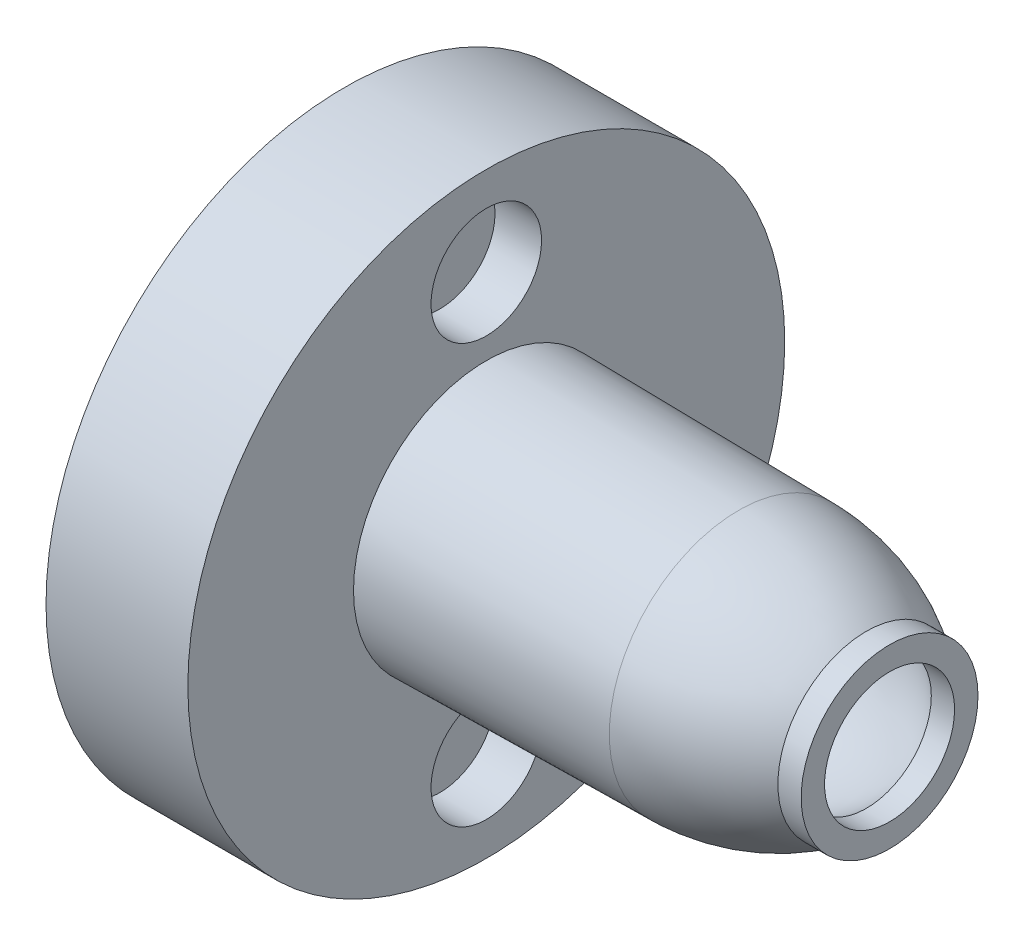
ISO-10303-21;
HEADER;
FILE_DESCRIPTION(('STEP AP214'),'2;1');
FILE_NAME('part.step','',(''),(''),'','','');
FILE_SCHEMA(('AUTOMOTIVE_DESIGN { 1 0 10303 214 1 1 1 1 }'));
ENDSEC;
DATA;
#1=APPLICATION_CONTEXT('core data for automotive mechanical design processes');
#2=APPLICATION_PROTOCOL_DEFINITION('international standard','automotive_design',2000,#1);
#3=PRODUCT_CONTEXT('',#1,'mechanical');
#4=PRODUCT('Part','Part','',(#3));
#5=PRODUCT_RELATED_PRODUCT_CATEGORY('part','',(#4));
#6=PRODUCT_DEFINITION_FORMATION('','',#4);
#7=PRODUCT_DEFINITION_CONTEXT('part definition',#1,'design');
#8=PRODUCT_DEFINITION('design','',#6,#7);
#9=PRODUCT_DEFINITION_SHAPE('','',#8);
#10=(LENGTH_UNIT() NAMED_UNIT(*) SI_UNIT(.MILLI.,.METRE.));
#11=(NAMED_UNIT(*) PLANE_ANGLE_UNIT() SI_UNIT($,.RADIAN.));
#12=(NAMED_UNIT(*) SI_UNIT($,.STERADIAN.) SOLID_ANGLE_UNIT());
#13=UNCERTAINTY_MEASURE_WITH_UNIT(LENGTH_MEASURE(1.E-05),#10,'distance_accuracy_value','');
#14=(GEOMETRIC_REPRESENTATION_CONTEXT(3) GLOBAL_UNCERTAINTY_ASSIGNED_CONTEXT((#13)) GLOBAL_UNIT_ASSIGNED_CONTEXT((#10,
#11,#12)) REPRESENTATION_CONTEXT('',''));
#15=CARTESIAN_POINT('',(0.,0.,0.));
#16=DIRECTION('',(0.,0.,1.));
#17=DIRECTION('',(1.,0.,0.));
#18=AXIS2_PLACEMENT_3D('',#15,#16,#17);
#19=CARTESIAN_POINT('',(-6.48640049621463,0.,-4.15921814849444));
#20=DIRECTION('',(-1.,0.,0.));
#21=DIRECTION('',(0.,0.,1.));
#22=AXIS2_PLACEMENT_3D('',#19,#20,#21);
#23=PLANE('',#22);
#24=CARTESIAN_POINT('',(-6.48640049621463,0.,1.40090629));
#25=DIRECTION('',(1.,0.,0.));
#26=DIRECTION('',(0.,0.,-1.));
#27=AXIS2_PLACEMENT_3D('',#24,#25,#26);
#28=CIRCLE('',#27,4.63348082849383);
#29=CARTESIAN_POINT('',(-6.48640049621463,0.,-3.23257453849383));
#30=VERTEX_POINT('',#29);
#31=EDGE_CURVE('E46',#30,#30,#28,.T.);
#32=ORIENTED_EDGE('',*,*,#31,.T.);
#33=EDGE_LOOP('',(#32));
#34=FACE_BOUND('',#33,.T.);
#35=CARTESIAN_POINT('',(-6.48640049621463,0.,1.40090629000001));
#36=DIRECTION('',(1.,0.,0.));
#37=DIRECTION('',(0.,0.,-1.));
#38=AXIS2_PLACEMENT_3D('',#35,#36,#37);
#39=CIRCLE('',#38,4.76049260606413);
#40=CARTESIAN_POINT('',(-6.48640049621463,0.,-3.35958631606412));
#41=VERTEX_POINT('',#40);
#42=EDGE_CURVE('E10',#41,#41,#39,.T.);
#43=ORIENTED_EDGE('',*,*,#42,.F.);
#44=EDGE_LOOP('',(#43));
#45=FACE_BOUND('',#44,.T.);
#46=ADVANCED_FACE('F42',(#34,#45),#23,.T.);
#47=CARTESIAN_POINT('',(-6.50584710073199,0.,1.40090629));
#48=DIRECTION('',(1.,0.,0.));
#49=DIRECTION('',(0.,0.,-1.));
#50=AXIS2_PLACEMENT_3D('',#47,#48,#49);
#51=DEGENERATE_TOROIDAL_SURFACE('',#50,3.9331386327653,9.49328298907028,.F.);
#52=CARTESIAN_POINT('',(-6.48640049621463,0.,1.40090629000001));
#53=DIRECTION('',(1.,0.,0.));
#54=DIRECTION('',(0.,0.,-1.));
#55=AXIS2_PLACEMENT_3D('',#52,#53,#54);
#56=CIRCLE('',#55,5.56012443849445);
#57=CARTESIAN_POINT('',(-6.48640049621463,0.,-4.15921814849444));
#58=VERTEX_POINT('',#57);
#59=EDGE_CURVE('E61',#58,#58,#56,.T.);
#60=ORIENTED_EDGE('',*,*,#59,.T.);
#61=EDGE_LOOP('',(#60));
#62=FACE_BOUND('',#61,.T.);
#63=CARTESIAN_POINT('',(-0.999988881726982,0.,1.40090629));
#64=DIRECTION('',(1.,0.,0.));
#65=DIRECTION('',(0.,0.,-1.));
#66=AXIS2_PLACEMENT_3D('',#63,#64,#65);
#67=CIRCLE('',#66,3.80042116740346);
#68=CARTESIAN_POINT('',(-0.999988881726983,0.,-2.39951487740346));
#69=VERTEX_POINT('',#68);
#70=EDGE_CURVE('E69',#69,#69,#67,.T.);
#71=ORIENTED_EDGE('',*,*,#70,.F.);
#72=EDGE_LOOP('',(#71));
#73=FACE_BOUND('',#72,.T.);
#74=ADVANCED_FACE('F44',(#62,#73),#51,.F.);
#75=CARTESIAN_POINT('',(-6.6446004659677,0.,1.40090629));
#76=DIRECTION('',(1.,0.,0.));
#77=DIRECTION('',(0.,0.,-1.));
#78=AXIS2_PLACEMENT_3D('',#75,#76,#77);
#79=DEGENERATE_TOROIDAL_SURFACE('',#78,4.93992013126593,9.57470799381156,.F.);
#80=CARTESIAN_POINT('',(-1.00000016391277,0.,1.40090629));
#81=DIRECTION('',(1.,0.,0.));
#82=DIRECTION('',(0.,0.,-1.));
#83=AXIS2_PLACEMENT_3D('',#80,#81,#82);
#84=CIRCLE('',#83,2.794);
#85=CARTESIAN_POINT('',(-1.00000016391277,0.,-1.39309371));
#86=VERTEX_POINT('',#85);
#87=EDGE_CURVE('E56',#86,#86,#84,.T.);
#88=ORIENTED_EDGE('',*,*,#87,.T.);
#89=EDGE_LOOP('',(#88));
#90=FACE_BOUND('',#89,.T.);
#91=ORIENTED_EDGE('',*,*,#31,.F.);
#92=EDGE_LOOP('',(#91));
#93=FACE_BOUND('',#92,.T.);
#94=ADVANCED_FACE('F84',(#90,#93),#79,.T.);
#95=CARTESIAN_POINT('',(0.,0.,1.40090629));
#96=DIRECTION('',(1.,0.,0.));
#97=DIRECTION('',(0.,0.,-1.));
#98=AXIS2_PLACEMENT_3D('',#95,#96,#97);
#99=CYLINDRICAL_SURFACE('',#98,2.794);
#100=CARTESIAN_POINT('',(1.22508245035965E-05,0.,1.40090629));
#101=DIRECTION('',(1.,0.,0.));
#102=DIRECTION('',(0.,0.,-1.));
#103=AXIS2_PLACEMENT_3D('',#100,#101,#102);
#104=CIRCLE('',#103,2.794);
#105=CARTESIAN_POINT('',(1.22508245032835E-05,0.,-1.39309371));
#106=VERTEX_POINT('',#105);
#107=EDGE_CURVE('E77',#106,#106,#104,.T.);
#108=ORIENTED_EDGE('',*,*,#107,.T.);
#109=EDGE_LOOP('',(#108));
#110=FACE_BOUND('',#109,.T.);
#111=ORIENTED_EDGE('',*,*,#87,.F.);
#112=EDGE_LOOP('',(#111));
#113=FACE_BOUND('',#112,.T.);
#114=ADVANCED_FACE('F87',(#110,#113),#99,.F.);
#115=CARTESIAN_POINT('',(1.22508245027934E-05,0.,-2.39951487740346));
#116=DIRECTION('',(1.,0.,0.));
#117=DIRECTION('',(0.,0.,-1.));
#118=AXIS2_PLACEMENT_3D('',#115,#116,#117);
#119=PLANE('',#118);
#120=CARTESIAN_POINT('',(1.22508245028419E-05,0.,1.40090629));
#121=DIRECTION('',(1.,0.,0.));
#122=DIRECTION('',(0.,0.,-1.));
#123=AXIS2_PLACEMENT_3D('',#120,#121,#122);
#124=CIRCLE('',#123,3.80042116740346);
#125=CARTESIAN_POINT('',(1.22508245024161E-05,0.,-2.39951487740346));
#126=VERTEX_POINT('',#125);
#127=EDGE_CURVE('E73',#126,#126,#124,.T.);
#128=ORIENTED_EDGE('',*,*,#127,.T.);
#129=EDGE_LOOP('',(#128));
#130=FACE_BOUND('',#129,.T.);
#131=ORIENTED_EDGE('',*,*,#107,.F.);
#132=EDGE_LOOP('',(#131));
#133=FACE_BOUND('',#132,.T.);
#134=ADVANCED_FACE('F89',(#130,#133),#119,.T.);
#135=CARTESIAN_POINT('',(0.,0.,1.40090629));
#136=DIRECTION('',(1.,0.,0.));
#137=DIRECTION('',(0.,0.,-1.));
#138=AXIS2_PLACEMENT_3D('',#135,#136,#137);
#139=CYLINDRICAL_SURFACE('',#138,3.80042116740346);
#140=ORIENTED_EDGE('',*,*,#70,.T.);
#141=EDGE_LOOP('',(#140));
#142=FACE_BOUND('',#141,.T.);
#143=ORIENTED_EDGE('',*,*,#127,.F.);
#144=EDGE_LOOP('',(#143));
#145=FACE_BOUND('',#144,.T.);
#146=ADVANCED_FACE('F96',(#142,#145),#139,.T.);
#147=CARTESIAN_POINT('',(-6.48640049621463,0.,1.40090629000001));
#148=DIRECTION('',(-1.,0.,0.));
#149=DIRECTION('',(0.,0.,1.));
#150=AXIS2_PLACEMENT_3D('',#147,#148,#149);
#151=CONICAL_SURFACE('',#150,5.56012443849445,0.0136183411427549);
#152=CARTESIAN_POINT('',(-17.3322001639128,0.,1.40090629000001));
#153=DIRECTION('',(1.,0.,0.));
#154=DIRECTION('',(0.,0.,-1.));
#155=AXIS2_PLACEMENT_3D('',#152,#153,#154);
#156=CIRCLE('',#155,5.7078353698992);
#157=CARTESIAN_POINT('',(-17.3322001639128,0.,-4.30692907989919));
#158=VERTEX_POINT('',#157);
#159=EDGE_CURVE('E65',#158,#158,#156,.T.);
#160=ORIENTED_EDGE('',*,*,#159,.T.);
#161=EDGE_LOOP('',(#160));
#162=FACE_BOUND('',#161,.T.);
#163=ORIENTED_EDGE('',*,*,#59,.F.);
#164=EDGE_LOOP('',(#163));
#165=FACE_BOUND('',#164,.T.);
#166=ADVANCED_FACE('F117',(#162,#165),#151,.T.);
#167=CARTESIAN_POINT('',(-6.48640049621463,0.,1.40090629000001));
#168=DIRECTION('',(-1.,0.,0.));
#169=DIRECTION('',(0.,0.,1.));
#170=AXIS2_PLACEMENT_3D('',#167,#168,#169);
#171=CONICAL_SURFACE('',#170,4.76049260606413,0.0136183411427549);
#172=CARTESIAN_POINT('',(-23.4282001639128,0.,1.40090629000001));
#173=DIRECTION('',(1.,0.,0.));
#174=DIRECTION('',(0.,0.,-1.));
#175=AXIS2_PLACEMENT_3D('',#172,#173,#174);
#176=CIRCLE('',#175,4.99122607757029);
#177=CARTESIAN_POINT('',(-23.4282001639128,0.,-3.59031978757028));
#178=VERTEX_POINT('',#177);
#179=EDGE_CURVE('E59',#178,#178,#176,.T.);
#180=ORIENTED_EDGE('',*,*,#179,.F.);
#181=EDGE_LOOP('',(#180));
#182=FACE_BOUND('',#181,.T.);
#183=ORIENTED_EDGE('',*,*,#42,.T.);
#184=EDGE_LOOP('',(#183));
#185=FACE_BOUND('',#184,.T.);
#186=ADVANCED_FACE('F124',(#182,#185),#171,.F.);
#187=CARTESIAN_POINT('',(-23.4282001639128,0.,-11.42609371));
#188=DIRECTION('',(-1.,0.,0.));
#189=DIRECTION('',(0.,0.,1.));
#190=AXIS2_PLACEMENT_3D('',#187,#188,#189);
#191=PLANE('',#190);
#192=ORIENTED_EDGE('',*,*,#179,.T.);
#193=EDGE_LOOP('',(#192));
#194=FACE_BOUND('',#193,.T.);
#195=CARTESIAN_POINT('',(-23.4282001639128,0.,1.40090629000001));
#196=DIRECTION('',(1.,0.,0.));
#197=DIRECTION('',(0.,0.,-1.));
#198=AXIS2_PLACEMENT_3D('',#195,#196,#197);
#199=CIRCLE('',#198,12.827);
#200=CARTESIAN_POINT('',(-23.4282001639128,0.,-11.42609371));
#201=VERTEX_POINT('',#200);
#202=EDGE_CURVE('E170',#201,#201,#199,.T.);
#203=ORIENTED_EDGE('',*,*,#202,.F.);
#204=EDGE_LOOP('',(#203));
#205=FACE_BOUND('',#204,.T.);
#206=ADVANCED_FACE('F130',(#194,#205),#191,.T.);
#207=CARTESIAN_POINT('',(8.32179983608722,0.,1.40090629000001));
#208=DIRECTION('',(1.,0.,0.));
#209=DIRECTION('',(0.,0.,-1.));
#210=AXIS2_PLACEMENT_3D('',#207,#208,#209);
#211=CYLINDRICAL_SURFACE('',#210,12.827);
#212=ORIENTED_EDGE('',*,*,#202,.T.);
#213=EDGE_LOOP('',(#212));
#214=FACE_BOUND('',#213,.T.);
#215=CARTESIAN_POINT('',(-17.3322001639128,0.,1.40090629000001));
#216=DIRECTION('',(1.,0.,0.));
#217=DIRECTION('',(0.,0.,-1.));
#218=AXIS2_PLACEMENT_3D('',#215,#216,#217);
#219=CIRCLE('',#218,12.827);
#220=CARTESIAN_POINT('',(-17.3322001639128,0.,-11.42609371));
#221=VERTEX_POINT('',#220);
#222=EDGE_CURVE('E164',#221,#221,#219,.T.);
#223=ORIENTED_EDGE('',*,*,#222,.F.);
#224=EDGE_LOOP('',(#223));
#225=FACE_BOUND('',#224,.T.);
#226=ADVANCED_FACE('F134',(#214,#225),#211,.T.);
#227=CARTESIAN_POINT('',(-17.3322001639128,0.,-7.10809370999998));
#228=DIRECTION('',(1.,0.,0.));
#229=DIRECTION('',(0.,0.,-1.));
#230=AXIS2_PLACEMENT_3D('',#227,#228,#229);
#231=PLANE('',#230);
#232=CARTESIAN_POINT('',(-17.3322001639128,-9.,1.40090629));
#233=DIRECTION('',(1.,0.,0.));
#234=DIRECTION('',(0.,0.,-1.));
#235=AXIS2_PLACEMENT_3D('',#232,#233,#234);
#236=CIRCLE('',#235,2.375);
#237=CARTESIAN_POINT('',(-17.3322001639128,-9.,-0.974093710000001));
#238=VERTEX_POINT('',#237);
#239=EDGE_CURVE('E165',#238,#238,#236,.T.);
#240=ORIENTED_EDGE('',*,*,#239,.F.);
#241=EDGE_LOOP('',(#240));
#242=FACE_BOUND('',#241,.T.);
#243=CARTESIAN_POINT('',(-17.3322001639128,9.,1.40090629));
#244=DIRECTION('',(1.,0.,0.));
#245=DIRECTION('',(0.,0.,-1.));
#246=AXIS2_PLACEMENT_3D('',#243,#244,#245);
#247=CIRCLE('',#246,2.375);
#248=CARTESIAN_POINT('',(-17.3322001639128,9.,-0.974093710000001));
#249=VERTEX_POINT('',#248);
#250=EDGE_CURVE('E173',#249,#249,#247,.T.);
#251=ORIENTED_EDGE('',*,*,#250,.F.);
#252=EDGE_LOOP('',(#251));
#253=FACE_BOUND('',#252,.T.);
#254=ORIENTED_EDGE('',*,*,#159,.F.);
#255=EDGE_LOOP('',(#254));
#256=FACE_BOUND('',#255,.T.);
#257=ORIENTED_EDGE('',*,*,#222,.T.);
#258=EDGE_LOOP('',(#257));
#259=FACE_BOUND('',#258,.T.);
#260=ADVANCED_FACE('F138',(#242,#253,#256,#259),#231,.T.);
#261=CARTESIAN_POINT('',(-19.3322001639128,9.,1.40090629));
#262=DIRECTION('',(1.,0.,0.));
#263=DIRECTION('',(0.,0.,-1.));
#264=AXIS2_PLACEMENT_3D('',#261,#262,#263);
#265=CYLINDRICAL_SURFACE('',#264,2.375);
#266=CARTESIAN_POINT('',(-19.3322001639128,9.,1.40090629));
#267=DIRECTION('',(1.,0.,0.));
#268=DIRECTION('',(0.,0.,-1.));
#269=AXIS2_PLACEMENT_3D('',#266,#267,#268);
#270=CIRCLE('',#269,2.375);
#271=CARTESIAN_POINT('',(-19.3322001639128,9.,-0.974093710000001));
#272=VERTEX_POINT('',#271);
#273=EDGE_CURVE('E179',#272,#272,#270,.T.);
#274=ORIENTED_EDGE('',*,*,#273,.F.);
#275=EDGE_LOOP('',(#274));
#276=FACE_BOUND('',#275,.T.);
#277=ORIENTED_EDGE('',*,*,#250,.T.);
#278=EDGE_LOOP('',(#277));
#279=FACE_BOUND('',#278,.T.);
#280=ADVANCED_FACE('F142',(#276,#279),#265,.F.);
#281=CARTESIAN_POINT('',(-19.3322001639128,9.,1.40090629));
#282=DIRECTION('',(1.,0.,0.));
#283=DIRECTION('',(0.,0.,-1.));
#284=AXIS2_PLACEMENT_3D('',#281,#282,#283);
#285=PLANE('',#284);
#286=ORIENTED_EDGE('',*,*,#273,.T.);
#287=EDGE_LOOP('',(#286));
#288=FACE_BOUND('',#287,.T.);
#289=ADVANCED_FACE('F144',(#288),#285,.T.);
#290=CARTESIAN_POINT('',(-19.3322001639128,-9.,1.40090629));
#291=DIRECTION('',(1.,0.,0.));
#292=DIRECTION('',(0.,0.,-1.));
#293=AXIS2_PLACEMENT_3D('',#290,#291,#292);
#294=CYLINDRICAL_SURFACE('',#293,2.375);
#295=CARTESIAN_POINT('',(-19.3322001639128,-9.,1.40090629));
#296=DIRECTION('',(1.,0.,0.));
#297=DIRECTION('',(0.,0.,-1.));
#298=AXIS2_PLACEMENT_3D('',#295,#296,#297);
#299=CIRCLE('',#298,2.375);
#300=CARTESIAN_POINT('',(-19.3322001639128,-9.,-0.974093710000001));
#301=VERTEX_POINT('',#300);
#302=EDGE_CURVE('E162',#301,#301,#299,.T.);
#303=ORIENTED_EDGE('',*,*,#302,.F.);
#304=EDGE_LOOP('',(#303));
#305=FACE_BOUND('',#304,.T.);
#306=ORIENTED_EDGE('',*,*,#239,.T.);
#307=EDGE_LOOP('',(#306));
#308=FACE_BOUND('',#307,.T.);
#309=ADVANCED_FACE('F147',(#305,#308),#294,.F.);
#310=CARTESIAN_POINT('',(-19.3322001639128,-9.,1.40090629));
#311=DIRECTION('',(1.,0.,0.));
#312=DIRECTION('',(0.,0.,-1.));
#313=AXIS2_PLACEMENT_3D('',#310,#311,#312);
#314=PLANE('',#313);
#315=ORIENTED_EDGE('',*,*,#302,.T.);
#316=EDGE_LOOP('',(#315));
#317=FACE_BOUND('',#316,.T.);
#318=ADVANCED_FACE('F154',(#317),#314,.T.);
#319=CLOSED_SHELL('',(#46,#74,#94,#114,#134,#146,#166,#186,#206,#226,#260,#280,#289,#309,#318));
#320=MANIFOLD_SOLID_BREP('B2',#319);
#321=ADVANCED_BREP_SHAPE_REPRESENTATION('',(#18,#320),#14);
#322=SHAPE_DEFINITION_REPRESENTATION(#9,#321);
ENDSEC;
END-ISO-10303-21;
